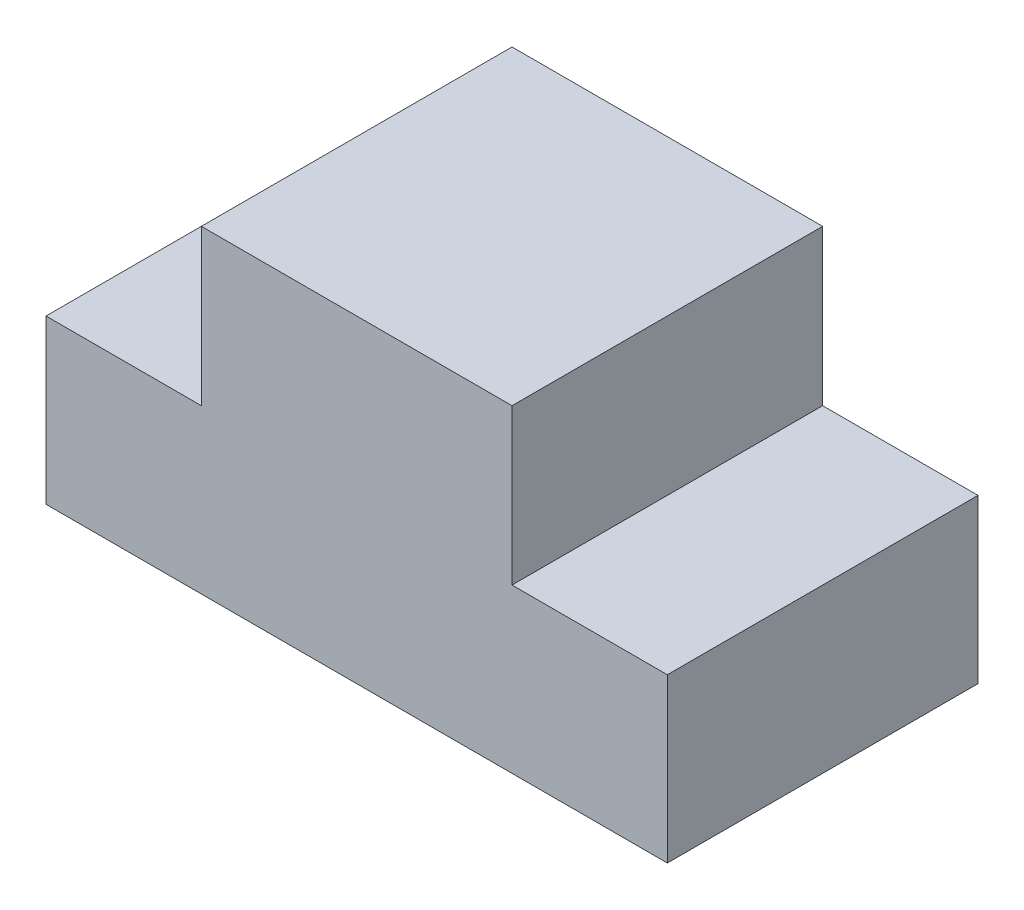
ISO-10303-21;
HEADER;
FILE_DESCRIPTION(('STEP AP214'),'2;1');
FILE_NAME('part.step','',(''),(''),'','','');
FILE_SCHEMA(('AUTOMOTIVE_DESIGN { 1 0 10303 214 1 1 1 1 }'));
ENDSEC;
DATA;
#1=APPLICATION_CONTEXT('core data for automotive mechanical design processes');
#2=APPLICATION_PROTOCOL_DEFINITION('international standard','automotive_design',2000,#1);
#3=PRODUCT_CONTEXT('',#1,'mechanical');
#4=PRODUCT('Part','Part','',(#3));
#5=PRODUCT_RELATED_PRODUCT_CATEGORY('part','',(#4));
#6=PRODUCT_DEFINITION_FORMATION('','',#4);
#7=PRODUCT_DEFINITION_CONTEXT('part definition',#1,'design');
#8=PRODUCT_DEFINITION('design','',#6,#7);
#9=PRODUCT_DEFINITION_SHAPE('','',#8);
#10=(LENGTH_UNIT() NAMED_UNIT(*) SI_UNIT(.MILLI.,.METRE.));
#11=(NAMED_UNIT(*) PLANE_ANGLE_UNIT() SI_UNIT($,.RADIAN.));
#12=(NAMED_UNIT(*) SI_UNIT($,.STERADIAN.) SOLID_ANGLE_UNIT());
#13=UNCERTAINTY_MEASURE_WITH_UNIT(LENGTH_MEASURE(1.E-05),#10,'distance_accuracy_value','');
#14=(GEOMETRIC_REPRESENTATION_CONTEXT(3) GLOBAL_UNCERTAINTY_ASSIGNED_CONTEXT((#13)) GLOBAL_UNIT_ASSIGNED_CONTEXT((#10,
#11,#12)) REPRESENTATION_CONTEXT('',''));
#15=CARTESIAN_POINT('',(0.,0.,0.));
#16=DIRECTION('',(0.,0.,1.));
#17=DIRECTION('',(1.,0.,0.));
#18=AXIS2_PLACEMENT_3D('',#15,#16,#17);
#19=CARTESIAN_POINT('',(-76.2,40.,38.1));
#20=DIRECTION('',(0.,-1.,0.));
#21=DIRECTION('',(1.,0.,0.));
#22=AXIS2_PLACEMENT_3D('',#19,#20,#21);
#23=PLANE('',#22);
#24=DIRECTION('',(0.,0.,-1.));
#25=VECTOR('',#24,1.);
#26=CARTESIAN_POINT('',(38.1,40.,38.1));
#27=LINE('',#26,#25);
#28=CARTESIAN_POINT('',(38.1,40.,38.1));
#29=VERTEX_POINT('',#28);
#30=CARTESIAN_POINT('',(38.1,40.,-38.1));
#31=VERTEX_POINT('',#30);
#32=EDGE_CURVE('E47',#29,#31,#27,.T.);
#33=ORIENTED_EDGE('',*,*,#32,.F.);
#34=DIRECTION('',(-1.,0.,0.));
#35=VECTOR('',#34,1.);
#36=CARTESIAN_POINT('',(-76.2,40.,38.1));
#37=LINE('',#36,#35);
#38=CARTESIAN_POINT('',(76.2,40.,38.1));
#39=VERTEX_POINT('',#38);
#40=EDGE_CURVE('E104',#39,#29,#37,.T.);
#41=ORIENTED_EDGE('',*,*,#40,.F.);
#42=DIRECTION('',(0.,0.,-1.));
#43=VECTOR('',#42,1.);
#44=CARTESIAN_POINT('',(76.2,40.,38.1));
#45=LINE('',#44,#43);
#46=CARTESIAN_POINT('',(76.2,40.,-38.1));
#47=VERTEX_POINT('',#46);
#48=EDGE_CURVE('E167',#39,#47,#45,.T.);
#49=ORIENTED_EDGE('',*,*,#48,.T.);
#50=DIRECTION('',(-1.,0.,0.));
#51=VECTOR('',#50,1.);
#52=CARTESIAN_POINT('',(-76.2,40.,-38.1));
#53=LINE('',#52,#51);
#54=EDGE_CURVE('E163',#47,#31,#53,.T.);
#55=ORIENTED_EDGE('',*,*,#54,.T.);
#56=EDGE_LOOP('',(#33,#41,#49,#55));
#57=FACE_BOUND('',#56,.T.);
#58=ADVANCED_FACE('F30',(#57),#23,.F.);
#59=DIRECTION('',(0.,0.,1.));
#60=VECTOR('',#59,1.);
#61=CARTESIAN_POINT('',(-38.1,40.,38.1));
#62=LINE('',#61,#60);
#63=CARTESIAN_POINT('',(-38.1,40.,-38.1));
#64=VERTEX_POINT('',#63);
#65=CARTESIAN_POINT('',(-38.1,40.,38.1));
#66=VERTEX_POINT('',#65);
#67=EDGE_CURVE('E55',#64,#66,#62,.T.);
#68=ORIENTED_EDGE('',*,*,#67,.F.);
#69=CARTESIAN_POINT('',(-76.2,40.,-38.1));
#70=VERTEX_POINT('',#69);
#71=EDGE_CURVE('E154',#64,#70,#53,.T.);
#72=ORIENTED_EDGE('',*,*,#71,.T.);
#73=DIRECTION('',(0.,0.,-1.));
#74=VECTOR('',#73,1.);
#75=CARTESIAN_POINT('',(-76.2,40.,38.1));
#76=LINE('',#75,#74);
#77=CARTESIAN_POINT('',(-76.2,40.,38.1));
#78=VERTEX_POINT('',#77);
#79=EDGE_CURVE('E99',#78,#70,#76,.T.);
#80=ORIENTED_EDGE('',*,*,#79,.F.);
#81=EDGE_CURVE('E96',#66,#78,#37,.T.);
#82=ORIENTED_EDGE('',*,*,#81,.F.);
#83=EDGE_LOOP('',(#68,#72,#80,#82));
#84=FACE_BOUND('',#83,.T.);
#85=ADVANCED_FACE('F97',(#84),#23,.F.);
#86=CARTESIAN_POINT('',(-76.2,0.,38.1));
#87=DIRECTION('',(1.,0.,0.));
#88=DIRECTION('',(0.,0.,-1.));
#89=AXIS2_PLACEMENT_3D('',#86,#87,#88);
#90=PLANE('',#89);
#91=DIRECTION('',(0.,-1.,0.));
#92=VECTOR('',#91,1.);
#93=CARTESIAN_POINT('',(-76.2,0.,-38.1));
#94=LINE('',#93,#92);
#95=CARTESIAN_POINT('',(-76.2,0.,-38.1));
#96=VERTEX_POINT('',#95);
#97=EDGE_CURVE('E134',#70,#96,#94,.T.);
#98=ORIENTED_EDGE('',*,*,#97,.T.);
#99=DIRECTION('',(0.,0.,-1.));
#100=VECTOR('',#99,1.);
#101=CARTESIAN_POINT('',(-76.2,0.,38.1));
#102=LINE('',#101,#100);
#103=CARTESIAN_POINT('',(-76.2,0.,38.1));
#104=VERTEX_POINT('',#103);
#105=EDGE_CURVE('E11',#104,#96,#102,.T.);
#106=ORIENTED_EDGE('',*,*,#105,.F.);
#107=DIRECTION('',(0.,-1.,0.));
#108=VECTOR('',#107,1.);
#109=CARTESIAN_POINT('',(-76.2,0.,38.1));
#110=LINE('',#109,#108);
#111=EDGE_CURVE('E157',#78,#104,#110,.T.);
#112=ORIENTED_EDGE('',*,*,#111,.F.);
#113=ORIENTED_EDGE('',*,*,#79,.T.);
#114=EDGE_LOOP('',(#98,#106,#112,#113));
#115=FACE_BOUND('',#114,.T.);
#116=ADVANCED_FACE('F32',(#115),#90,.F.);
#117=CARTESIAN_POINT('',(-76.2,0.,38.1));
#118=DIRECTION('',(0.,1.,0.));
#119=DIRECTION('',(-1.,0.,0.));
#120=AXIS2_PLACEMENT_3D('',#117,#118,#119);
#121=PLANE('',#120);
#122=DIRECTION('',(1.,0.,0.));
#123=VECTOR('',#122,1.);
#124=CARTESIAN_POINT('',(-76.2,0.,-38.1));
#125=LINE('',#124,#123);
#126=CARTESIAN_POINT('',(76.2,0.,-38.1));
#127=VERTEX_POINT('',#126);
#128=EDGE_CURVE('E150',#96,#127,#125,.T.);
#129=ORIENTED_EDGE('',*,*,#128,.T.);
#130=DIRECTION('',(0.,0.,-1.));
#131=VECTOR('',#130,1.);
#132=CARTESIAN_POINT('',(76.2,0.,38.1));
#133=LINE('',#132,#131);
#134=CARTESIAN_POINT('',(76.2,0.,38.1));
#135=VERTEX_POINT('',#134);
#136=EDGE_CURVE('E39',#135,#127,#133,.T.);
#137=ORIENTED_EDGE('',*,*,#136,.F.);
#138=DIRECTION('',(1.,0.,0.));
#139=VECTOR('',#138,1.);
#140=CARTESIAN_POINT('',(-76.2,0.,38.1));
#141=LINE('',#140,#139);
#142=EDGE_CURVE('E187',#104,#135,#141,.T.);
#143=ORIENTED_EDGE('',*,*,#142,.F.);
#144=ORIENTED_EDGE('',*,*,#105,.T.);
#145=EDGE_LOOP('',(#129,#137,#143,#144));
#146=FACE_BOUND('',#145,.T.);
#147=ADVANCED_FACE('F190',(#146),#121,.F.);
#148=CARTESIAN_POINT('',(76.2,0.,38.1));
#149=DIRECTION('',(-1.,0.,0.));
#150=DIRECTION('',(0.,-1.,0.));
#151=AXIS2_PLACEMENT_3D('',#148,#149,#150);
#152=PLANE('',#151);
#153=DIRECTION('',(0.,1.,0.));
#154=VECTOR('',#153,1.);
#155=CARTESIAN_POINT('',(76.2,0.,-38.1));
#156=LINE('',#155,#154);
#157=EDGE_CURVE('E152',#127,#47,#156,.T.);
#158=ORIENTED_EDGE('',*,*,#157,.T.);
#159=ORIENTED_EDGE('',*,*,#48,.F.);
#160=DIRECTION('',(0.,1.,0.));
#161=VECTOR('',#160,1.);
#162=CARTESIAN_POINT('',(76.2,0.,38.1));
#163=LINE('',#162,#161);
#164=EDGE_CURVE('E105',#135,#39,#163,.T.);
#165=ORIENTED_EDGE('',*,*,#164,.F.);
#166=ORIENTED_EDGE('',*,*,#136,.T.);
#167=EDGE_LOOP('',(#158,#159,#165,#166));
#168=FACE_BOUND('',#167,.T.);
#169=ADVANCED_FACE('F193',(#168),#152,.F.);
#170=CARTESIAN_POINT('',(-76.2,40.,38.1));
#171=DIRECTION('',(0.,0.,-1.));
#172=DIRECTION('',(-1.,0.,0.));
#173=AXIS2_PLACEMENT_3D('',#170,#171,#172);
#174=PLANE('',#173);
#175=ORIENTED_EDGE('',*,*,#111,.T.);
#176=ORIENTED_EDGE('',*,*,#142,.T.);
#177=ORIENTED_EDGE('',*,*,#164,.T.);
#178=ORIENTED_EDGE('',*,*,#40,.T.);
#179=DIRECTION('',(0.,-1.,0.));
#180=VECTOR('',#179,1.);
#181=CARTESIAN_POINT('',(38.1,78.1,38.1));
#182=LINE('',#181,#180);
#183=CARTESIAN_POINT('',(38.1,78.1,38.1));
#184=VERTEX_POINT('',#183);
#185=EDGE_CURVE('E121',#184,#29,#182,.T.);
#186=ORIENTED_EDGE('',*,*,#185,.F.);
#187=DIRECTION('',(1.,0.,0.));
#188=VECTOR('',#187,1.);
#189=CARTESIAN_POINT('',(38.1,78.1,38.1));
#190=LINE('',#189,#188);
#191=CARTESIAN_POINT('',(-38.1,78.1,38.1));
#192=VERTEX_POINT('',#191);
#193=EDGE_CURVE('E120',#192,#184,#190,.T.);
#194=ORIENTED_EDGE('',*,*,#193,.F.);
#195=DIRECTION('',(0.,-1.,0.));
#196=VECTOR('',#195,1.);
#197=CARTESIAN_POINT('',(-38.1,78.1,38.1));
#198=LINE('',#197,#196);
#199=EDGE_CURVE('E112',#192,#66,#198,.T.);
#200=ORIENTED_EDGE('',*,*,#199,.T.);
#201=ORIENTED_EDGE('',*,*,#81,.T.);
#202=EDGE_LOOP('',(#175,#176,#177,#178,#186,#194,#200,#201));
#203=FACE_BOUND('',#202,.T.);
#204=ADVANCED_FACE('F118',(#203),#174,.F.);
#205=CARTESIAN_POINT('',(-76.2,40.,-38.1));
#206=DIRECTION('',(0.,0.,-1.));
#207=DIRECTION('',(-1.,0.,0.));
#208=AXIS2_PLACEMENT_3D('',#205,#206,#207);
#209=PLANE('',#208);
#210=ORIENTED_EDGE('',*,*,#97,.F.);
#211=ORIENTED_EDGE('',*,*,#71,.F.);
#212=DIRECTION('',(0.,-1.,0.));
#213=VECTOR('',#212,1.);
#214=CARTESIAN_POINT('',(-38.1,78.1,-38.1));
#215=LINE('',#214,#213);
#216=CARTESIAN_POINT('',(-38.1,78.1,-38.1));
#217=VERTEX_POINT('',#216);
#218=EDGE_CURVE('E115',#217,#64,#215,.T.);
#219=ORIENTED_EDGE('',*,*,#218,.F.);
#220=DIRECTION('',(-1.,0.,0.));
#221=VECTOR('',#220,1.);
#222=CARTESIAN_POINT('',(38.1,78.1,-38.1));
#223=LINE('',#222,#221);
#224=CARTESIAN_POINT('',(38.1,78.1,-38.1));
#225=VERTEX_POINT('',#224);
#226=EDGE_CURVE('E143',#225,#217,#223,.T.);
#227=ORIENTED_EDGE('',*,*,#226,.F.);
#228=DIRECTION('',(0.,-1.,0.));
#229=VECTOR('',#228,1.);
#230=CARTESIAN_POINT('',(38.1,78.1,-38.1));
#231=LINE('',#230,#229);
#232=EDGE_CURVE('E123',#225,#31,#231,.T.);
#233=ORIENTED_EDGE('',*,*,#232,.T.);
#234=ORIENTED_EDGE('',*,*,#54,.F.);
#235=ORIENTED_EDGE('',*,*,#157,.F.);
#236=ORIENTED_EDGE('',*,*,#128,.F.);
#237=EDGE_LOOP('',(#210,#211,#219,#227,#233,#234,#235,#236));
#238=FACE_BOUND('',#237,.T.);
#239=ADVANCED_FACE('F184',(#238),#209,.T.);
#240=CARTESIAN_POINT('',(38.1,78.1,38.1));
#241=DIRECTION('',(-1.,0.,0.));
#242=DIRECTION('',(0.,0.,1.));
#243=AXIS2_PLACEMENT_3D('',#240,#241,#242);
#244=PLANE('',#243);
#245=ORIENTED_EDGE('',*,*,#32,.T.);
#246=ORIENTED_EDGE('',*,*,#232,.F.);
#247=DIRECTION('',(0.,0.,-1.));
#248=VECTOR('',#247,1.);
#249=CARTESIAN_POINT('',(38.1,78.1,38.1));
#250=LINE('',#249,#248);
#251=EDGE_CURVE('E116',#184,#225,#250,.T.);
#252=ORIENTED_EDGE('',*,*,#251,.F.);
#253=ORIENTED_EDGE('',*,*,#185,.T.);
#254=EDGE_LOOP('',(#245,#246,#252,#253));
#255=FACE_BOUND('',#254,.T.);
#256=ADVANCED_FACE('F178',(#255),#244,.F.);
#257=CARTESIAN_POINT('',(-38.1,78.1,38.1));
#258=DIRECTION('',(1.,0.,0.));
#259=DIRECTION('',(0.,0.,-1.));
#260=AXIS2_PLACEMENT_3D('',#257,#258,#259);
#261=PLANE('',#260);
#262=ORIENTED_EDGE('',*,*,#67,.T.);
#263=ORIENTED_EDGE('',*,*,#199,.F.);
#264=DIRECTION('',(0.,0.,1.));
#265=VECTOR('',#264,1.);
#266=CARTESIAN_POINT('',(-38.1,78.1,38.1));
#267=LINE('',#266,#265);
#268=EDGE_CURVE('E145',#217,#192,#267,.T.);
#269=ORIENTED_EDGE('',*,*,#268,.F.);
#270=ORIENTED_EDGE('',*,*,#218,.T.);
#271=EDGE_LOOP('',(#262,#263,#269,#270));
#272=FACE_BOUND('',#271,.T.);
#273=ADVANCED_FACE('F110',(#272),#261,.F.);
#274=CARTESIAN_POINT('',(38.1,78.1,38.1));
#275=DIRECTION('',(0.,1.,0.));
#276=DIRECTION('',(-1.,0.,0.));
#277=AXIS2_PLACEMENT_3D('',#274,#275,#276);
#278=PLANE('',#277);
#279=ORIENTED_EDGE('',*,*,#251,.T.);
#280=ORIENTED_EDGE('',*,*,#226,.T.);
#281=ORIENTED_EDGE('',*,*,#268,.T.);
#282=ORIENTED_EDGE('',*,*,#193,.T.);
#283=EDGE_LOOP('',(#279,#280,#281,#282));
#284=FACE_BOUND('',#283,.T.);
#285=ADVANCED_FACE('F181',(#284),#278,.T.);
#286=CLOSED_SHELL('',(#58,#85,#116,#147,#169,#204,#239,#256,#273,#285));
#287=MANIFOLD_SOLID_BREP('B2',#286);
#288=ADVANCED_BREP_SHAPE_REPRESENTATION('',(#18,#287),#14);
#289=SHAPE_DEFINITION_REPRESENTATION(#9,#288);
ENDSEC;
END-ISO-10303-21;
